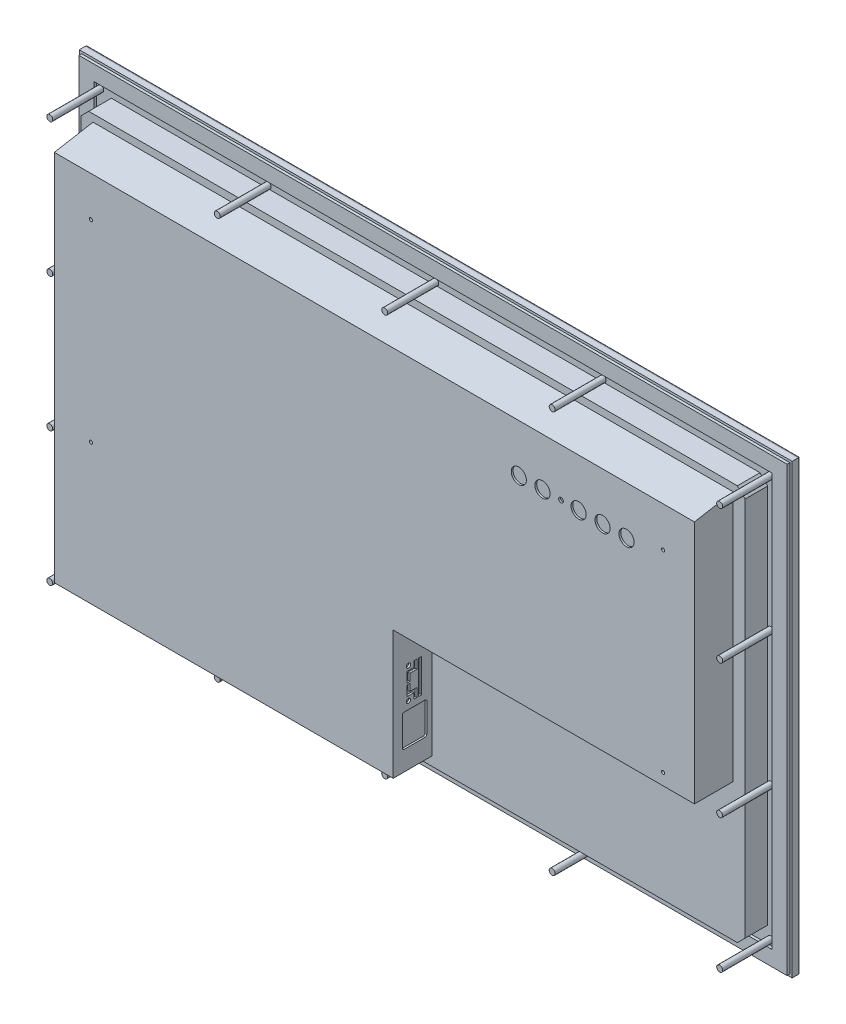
from build123d import *

# Parameters (mm, degrees)
SKETCH1_W                                 = 596.9
SKETCH1_H                                 = 374.65
BEZEL_DEPTH                               = 7.112
BEZEL_RADIUS_R                            = 2
SKETCH2_W                                 = 513.5372
SKETCH2_H                                 = 290.5252
WINDOW_DEPTH                              = 2.35
SKETCH3_W                                 = 593.09
SKETCH3_H                                 = 370.84
SKETCH3_W_2                               = 567.69
SKETCH3_H_2                               = 345.44
GASKET_DEPTH                              = 2.3
SKETCH5_R                                 = 2.5
PANEL_FRAME_STUDS_DEPTH                   = 42.7
BODY_DEPTH                                = 18.9738
REAR_COVER_DEPTH                          = 32.3596
REAR_COVER_SLOPE_ANGLE                    = 10
SKETCH10_R                                = 1.5875
VIDEO_TOUCH_INTERFACE_DEPTH               = 1.524
SKETCH11_R                                = 1.7907
SKETCH11_W                                = 2.54
SKETCH11_H                                = 27.94
POWER_AC_AND_DC_DEPTH                     = 1.524
SKETCH12_R                                = 6.35
SKETCH12_R_2                              = 1.9812
CONTROLS_BUTTONS_DEPTH                    = 1.524
F_6_32_ACCESSORY_BRACKET_HOLES_AT_2_COUNT = 2
F_6_32_ACCESSORY_BRACKET_HOLES_AT_2_PITCH = 161.3408
F_6_32_ACCESSORY_BRACKET_HOLES_AT_3_COUNT = 2
F_6_32_ACCESSORY_BRACKET_HOLES_AT_3_PITCH = 505.483934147
F_6_32_ACCESSORY_BRACKET_HOLES_AT_4_COUNT = 2
F_6_32_ACCESSORY_BRACKET_HOLES_AT_4_PITCH = 479.044


with BuildPart() as part:
    # Sketch1 → Bezel (new body)
    with BuildSketch(Plane.XY):
        Rectangle(SKETCH1_W, SKETCH1_H)
    extrude(amount=-BEZEL_DEPTH)

    # Bezel Radius
    bezel_radius_edges = [part.edges().sort_by_distance(p)[0] for p in [
        (298.45, 0, -7.112),
        (0, 187.325, -7.112),
        (-298.45, 0, -7.112),
        (0, -187.325, -7.112),
    ]]
    fillet(bezel_radius_edges, radius=BEZEL_RADIUS_R)

    # Sketch2 → Window (cut)
    with BuildSketch(Plane(origin=(0, 0, -7.112), x_dir=(-1, 0, 0), z_dir=(0, 0, -1))):
        Rectangle(SKETCH2_W, SKETCH2_H)
    extrude(amount=-WINDOW_DEPTH, mode=Mode.SUBTRACT)

    # Sketch3 → Gasket (add)
    with BuildSketch(Plane.XY):
        Rectangle(SKETCH3_W, SKETCH3_H)
        Rectangle(SKETCH3_W_2, SKETCH3_H_2, mode=Mode.SUBTRACT)
    extrude(amount=GASKET_DEPTH)

    # Sketch5 → Panel Frame Studs (add)
    with BuildSketch(Plane.XY):
        with Locations(Location((-280.4668, 168.1226, 0), (0, 0, 180))):
            Circle(SKETCH5_R)
        with Locations(Location((-140.2334, 168.1226, 0), (0, 0, 180))):
            Circle(SKETCH5_R)
        with Locations(Location((-140.2334, -168.148, 0), (0, 0, 180))):
            Circle(SKETCH5_R)
        with Locations(Location((0, 168.1226, 0), (0, 0, 180))):
            Circle(SKETCH5_R)
        with Locations(Location((0, -168.148, 0), (0, 0, 180))):
            Circle(SKETCH5_R)
        with Locations(Location((140.2334, 168.1226, 0), (0, 0, 180))):
            Circle(SKETCH5_R)
        with Locations(Location((140.2334, -168.148, 0), (0, 0, 180))):
            Circle(SKETCH5_R)
        with Locations(Location((280.4668, 168.1226, 0), (0, 0, 180))):
            Circle(SKETCH5_R)
        with Locations(Location((280.4668, -168.148, 0), (0, 0, 180))):
            Circle(SKETCH5_R)
        with Locations(Location((-280.4668, -168.148, 0), (0, 0, 180))):
            Circle(SKETCH5_R)
        with Locations(Location((-280.4668, 56.0324, 0), (0, 0, 180))):
            Circle(SKETCH5_R)
        with Locations(Location((280.4668, 56.0324, 0), (0, 0, 180))):
            Circle(SKETCH5_R)
        with Locations(Location((-280.4668, -56.0578, 0), (0, 0, 180))):
            Circle(SKETCH5_R)
        with Locations(Location((280.4668, -56.0578, 0), (0, 0, 180))):
            Circle(SKETCH5_R)
    extrude(amount=PANEL_FRAME_STUDS_DEPTH)


with BuildPart() as body_2:
    # Sketch6 → Body (new body)
    with BuildSketch(Plane.XY):
        Polygon((-277.9668, 159.21069713), (-271.55489713, 165.6226), (271.55489713, 165.6226), (277.9668, 159.21069713), (277.9668, -159.23609713), (271.55489713, -165.648), (-271.55489713, -165.648), (-277.9668, -159.23609713), align=None)
    extrude(amount=BODY_DEPTH)


with BuildPart() as body_3:
    # Sketch7 → Rear Cover (new body)
    with BuildSketch(Plane.XY.offset(18.9738)):
        Polygon((-267.97, 159.5374), (267.97, 159.5374), (267.97, -50.673), (15.7226, -50.673), (15.7226, -158.242), (-267.97, -158.242), align=None)
    extrude(amount=REAR_COVER_DEPTH)

    # Rear Cover Slope
    rear_cover_slope_faces = [body_3.faces().sort_by_distance(p)[0] for p in [
        (0, 159.5374, 35.1536),
    ]]
    draft(rear_cover_slope_faces, Plane.XY.offset(18.9738), REAR_COVER_SLOPE_ANGLE)

    # Sketch10 → Video _ Touch Interface (cut)
    with BuildSketch(Plane(origin=(0, -50.673, 0), x_dir=(1, 0, 0), z_dir=(0, 1, 0))):
        with Locations((126.483705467, -38.71651993)):
            Circle(SKETCH10_R)
        with Locations((93.971705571, -38.71651993)):
            Circle(SKETCH10_R)
        with Locations((162.658705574, -40.24051993)):
            Circle(SKETCH10_R)
        with Locations((137.658711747, -40.24051993)):
            Circle(SKETCH10_R)
        with Locations((196.145734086, -30.46151993)):
            Circle(SKETCH10_R)
        with Locations((221.145727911, -30.46151993)):
            Circle(SKETCH10_R)
        with BuildLine():
            Line((123.88970861, -41.25651993), (123.88970861, -36.17651993))
            ThreePointArc((123.88970861, -36.17651993), (123.00423367, -33.976815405), (120.841708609, -33.004060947))
            Line((120.841708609, -33.004060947), (99.613702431, -33.004060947))
            ThreePointArc((99.613702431, -33.004060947), (97.45117737, -33.976815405), (96.56570243, -36.17651993))
            Line((96.56570243, -36.17651993), (96.56570243, -41.25651993))
            ThreePointArc((96.56570243, -41.25651993), (97.45117737, -43.456224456), (99.613702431, -44.428978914))
            Line((99.613702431, -44.428978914), (120.841708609, -44.428978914))
            ThreePointArc((120.841708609, -44.428978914), (123.00423367, -43.456224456), (123.88970861, -41.25651993))
        make_face()
        with BuildLine():
            Line((160.318669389, -37.68781993), (160.318669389, -42.76781993))
            ThreePointArc((160.318669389, -42.76781993), (159.433194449, -44.967524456), (157.27066939, -45.940278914))
            Line((157.27066939, -45.940278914), (143.046669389, -45.940278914))
            ThreePointArc((143.046669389, -45.940278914), (140.884144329, -44.967524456), (139.998669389, -42.76781993))
            Line((139.998669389, -42.76781993), (139.998669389, -37.68781993))
            ThreePointArc((139.998669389, -37.68781993), (140.88414433, -35.488115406), (143.046669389, -34.515360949))
            Line((143.046669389, -34.515360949), (157.143097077, -34.512819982))
            ThreePointArc((157.143097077, -34.512819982), (159.388531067, -35.442553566), (160.318669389, -37.68781993))
        make_face()
        with BuildLine():
            Line((198.485691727, -27.934219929), (198.485691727, -33.01421993))
            ThreePointArc((198.485691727, -33.01421993), (199.371166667, -35.213924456), (201.533691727, -36.186678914))
            Line((201.533691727, -36.186678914), (215.630119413, -36.18921988))
            ThreePointArc((215.630119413, -36.18921988), (217.875553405, -35.259486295), (218.805691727, -33.01421993))
            Line((218.805691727, -33.01421993), (218.805691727, -27.93421993))
            ThreePointArc((218.805691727, -27.93421993), (217.920216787, -25.734515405), (215.757691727, -24.761760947))
            Line((215.757691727, -24.761760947), (201.533691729, -24.761760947))
            ThreePointArc((201.533691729, -24.761760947), (199.371166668, -25.734515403), (198.485691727, -27.934219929))
        make_face()
        with BuildLine():
            Line((252.253103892, -24.36551993), (236.251103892, -24.36551993))
            Line((236.251103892, -24.36551993), (236.251103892, -28.87401993))
            Line((236.251103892, -28.87401993), (231.806103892, -28.87401993))
            ThreePointArc((231.806103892, -28.87401993), (230.218603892, -30.46151993), (231.806103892, -32.04901993))
            Line((231.806103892, -32.04901993), (236.251103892, -32.04901993))
            Line((236.251103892, -32.04901993), (236.251103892, -36.55751993))
            Line((236.251103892, -36.55751993), (252.253103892, -36.55751993))
            Line((252.253103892, -36.55751993), (252.253103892, -32.04901993))
            Line((252.253103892, -32.04901993), (256.698103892, -32.04901993))
            ThreePointArc((256.698103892, -32.04901993), (258.285603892, -30.46151993), (256.698103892, -28.87401993))
            Line((256.698103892, -28.87401993), (252.253103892, -28.87401993))
            Line((252.253103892, -28.87401993), (252.253103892, -24.36551993))
        make_face()
    extrude(amount=VIDEO_TOUCH_INTERFACE_DEPTH, mode=Mode.SUBTRACT)

    # Sketch11 → Power AC and DC (cut)
    with BuildSketch(Plane.ZY.offset(-15.7226)):
        with Locations(Location((38.5318, -108.436796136, 0), (0, 0, 180))):
            Circle(SKETCH11_R)
        with Locations(Location((38.5318, -82.858996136, 0), (0, 0, 180))):
            Circle(SKETCH11_R)
        Polygon((34.036, -109.617896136), (34.036, -104.804596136), (39.9288, -104.804596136), (39.9288, -96.409896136), (37.3888, -96.409896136), (37.3888, -102.264596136), (31.496, -102.264596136), (31.496, -109.617896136), align=None)
        with Locations((28.702, -95.647896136)):
            Rectangle(SKETCH11_W, SKETCH11_H)
        Polygon((31.496, -81.677896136), (34.036, -81.677896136), (34.036, -86.491196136), (39.9288, -86.491196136), (39.9288, -94.885896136), (37.3888, -94.885896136), (37.3888, -89.031196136), (31.496, -89.031196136), align=None)
        with BuildLine():
            Line((23.177743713, -116.35005365), (23.177743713, -140.28955204))
            ThreePointArc((23.177743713, -140.28955204), (23.623559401, -141.366628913), (24.700177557, -141.813551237))
            Line((24.700177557, -141.813551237), (42.151552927, -141.813551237))
            ThreePointArc((42.151552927, -141.813551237), (43.229183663, -141.36718197), (43.675552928, -140.289551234))
            Line((43.675552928, -140.289551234), (43.675552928, -116.350052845))
            ThreePointArc((43.675552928, -116.350052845), (43.22973724, -115.272975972), (42.153119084, -114.82605365))
            Line((42.153119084, -114.82605365), (24.701743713, -114.82605365))
            ThreePointArc((24.701743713, -114.82605365), (23.624112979, -115.272422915), (23.177743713, -116.35005365))
        make_face()
    extrude(amount=POWER_AC_AND_DC_DEPTH, mode=Mode.SUBTRACT)

    # Sketch12 → Controls Buttons (cut)
    with BuildSketch(Plane.XY.offset(51.3334)):
        with Locations((120.9294, 113.7412)):
            Circle(SKETCH12_R)
        with Locations((140.7414, 113.7412)):
            Circle(SKETCH12_R)
        with Locations((170.9674, 113.7412)):
            Circle(SKETCH12_R)
        with Locations((191.0334, 113.7412)):
            Circle(SKETCH12_R)
        with Locations((156.2354, 113.7412)):
            Circle(SKETCH12_R_2)
        with Locations((211.0994, 113.7412)):
            Circle(SKETCH12_R)
    extrude(amount=-CONTROLS_BUTTONS_DEPTH, mode=Mode.SUBTRACT)

    # Sketch14 → 6-32 Accessory Bracket Holes (revolve, cut)
    with BuildSketch(Plane(origin=(-237.3122, -40.9956, 51.3334), x_dir=(0, -1, 0), z_dir=(1, 0, 0))):
        Polygon((0, 0), (0, 16.81469403), (1.35255, 16.002), (1.35255, 0), align=None)
    f_6_32_accessory_bracket_holes = revolve(axis=Axis((-237.3122, -40.9956, 57.6834), (0, 0, -1)), mode=Mode.SUBTRACT)

    # 6-32 Accessory Bracket Holes at 2: 6-32 Accessory Bracket Holes ×2
    with Locations(*[(0, i * F_6_32_ACCESSORY_BRACKET_HOLES_AT_2_PITCH, 0) for i in range(1, F_6_32_ACCESSORY_BRACKET_HOLES_AT_2_COUNT)]):
        add(f_6_32_accessory_bracket_holes, mode=Mode.SUBTRACT)

    # 6-32 Accessory Bracket Holes at 3: 6-32 Accessory Bracket Holes ×2
    with Locations(*[Vector(0.9476938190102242, 0.31918086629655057, 0) * (i * F_6_32_ACCESSORY_BRACKET_HOLES_AT_3_PITCH) for i in range(1, F_6_32_ACCESSORY_BRACKET_HOLES_AT_3_COUNT)]):
        add(f_6_32_accessory_bracket_holes, mode=Mode.SUBTRACT)

    # 6-32 Accessory Bracket Holes at 4: 6-32 Accessory Bracket Holes ×2
    with Locations(*[(i * F_6_32_ACCESSORY_BRACKET_HOLES_AT_4_PITCH, 0, 0) for i in range(1, F_6_32_ACCESSORY_BRACKET_HOLES_AT_4_COUNT)]):
        add(f_6_32_accessory_bracket_holes, mode=Mode.SUBTRACT)


solid = Compound([part.part, body_2.part, body_3.part])
